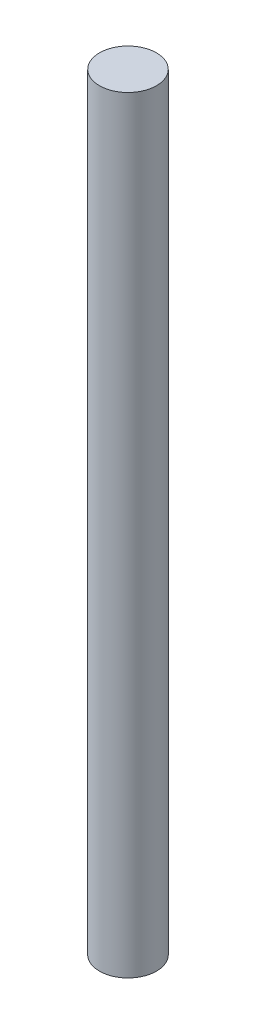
from build123d import *

# Parameters (mm, degrees)
SKIZZE1_R                       = 4
AUFSATZ_LINEAR_AUSTRAGEN1_DEPTH = 107.65


with BuildPart() as part:
    # Skizze1 → Aufsatz-Linear austragen1 (new body)
    with BuildSketch(Plane(origin=(0, 0, 0), x_dir=(1, 0, 0), z_dir=(0, 1, 0))):
        with Locations(Location((0, 0, 0), (0, 0, 270))):
            Circle(SKIZZE1_R)
    extrude(amount=AUFSATZ_LINEAR_AUSTRAGEN1_DEPTH)


solid = part.part
